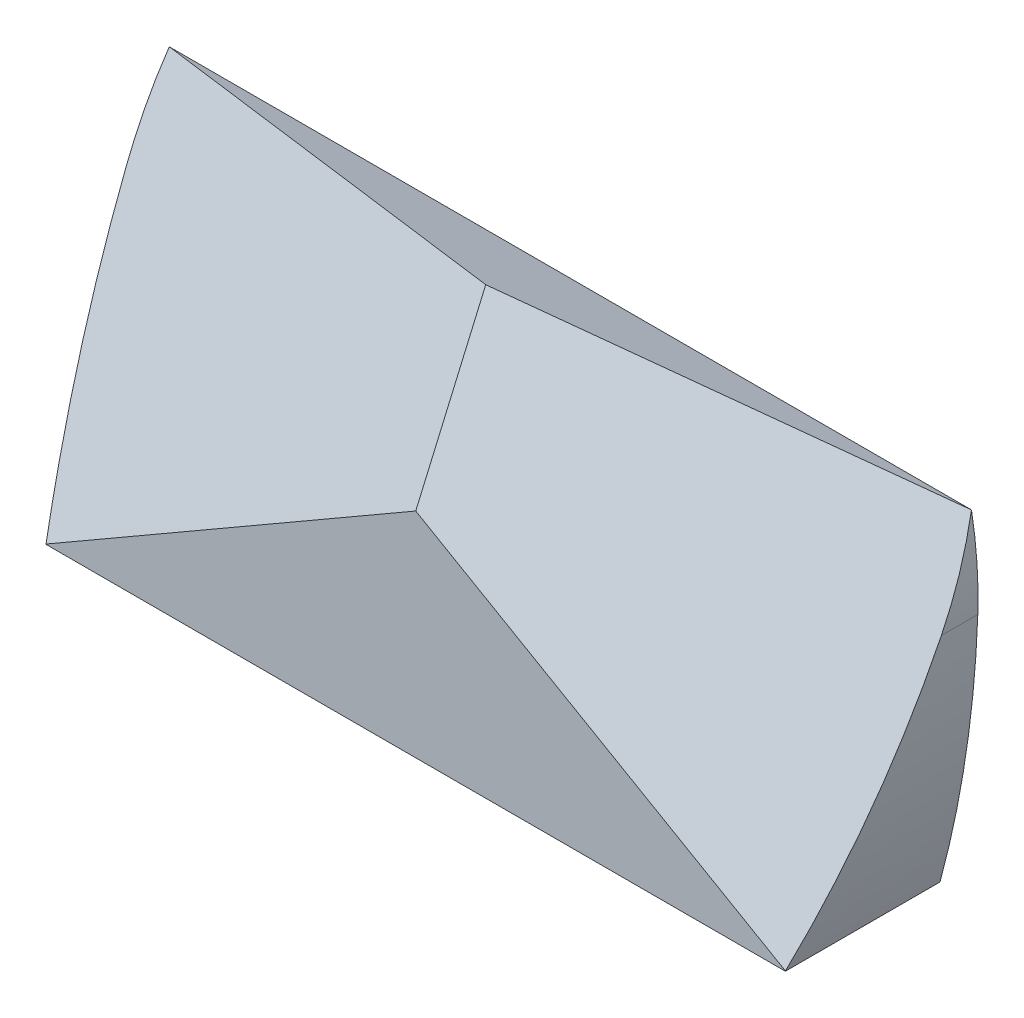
ISO-10303-21;
HEADER;
FILE_DESCRIPTION(('STEP AP214'),'2;1');
FILE_NAME('part.step','',(''),(''),'','','');
FILE_SCHEMA(('AUTOMOTIVE_DESIGN { 1 0 10303 214 1 1 1 1 }'));
ENDSEC;
DATA;
#1=APPLICATION_CONTEXT('core data for automotive mechanical design processes');
#2=APPLICATION_PROTOCOL_DEFINITION('international standard','automotive_design',2000,#1);
#3=PRODUCT_CONTEXT('',#1,'mechanical');
#4=PRODUCT('Part','Part','',(#3));
#5=PRODUCT_RELATED_PRODUCT_CATEGORY('part','',(#4));
#6=PRODUCT_DEFINITION_FORMATION('','',#4);
#7=PRODUCT_DEFINITION_CONTEXT('part definition',#1,'design');
#8=PRODUCT_DEFINITION('design','',#6,#7);
#9=PRODUCT_DEFINITION_SHAPE('','',#8);
#10=(LENGTH_UNIT() NAMED_UNIT(*) SI_UNIT(.MILLI.,.METRE.));
#11=(NAMED_UNIT(*) PLANE_ANGLE_UNIT() SI_UNIT($,.RADIAN.));
#12=(NAMED_UNIT(*) SI_UNIT($,.STERADIAN.) SOLID_ANGLE_UNIT());
#13=UNCERTAINTY_MEASURE_WITH_UNIT(LENGTH_MEASURE(1.E-05),#10,'distance_accuracy_value','');
#14=(GEOMETRIC_REPRESENTATION_CONTEXT(3) GLOBAL_UNCERTAINTY_ASSIGNED_CONTEXT((#13)) GLOBAL_UNIT_ASSIGNED_CONTEXT((#10,
#11,#12)) REPRESENTATION_CONTEXT('',''));
#15=CARTESIAN_POINT('',(0.,0.,0.));
#16=DIRECTION('',(0.,0.,1.));
#17=DIRECTION('',(1.,0.,0.));
#18=AXIS2_PLACEMENT_3D('',#15,#16,#17);
#19=CARTESIAN_POINT('',(31.1649708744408,36.0291040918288,-98.7276));
#20=DIRECTION('',(0.,0.,-1.));
#21=DIRECTION('',(-1.,0.,0.));
#22=AXIS2_PLACEMENT_3D('',#19,#20,#21);
#23=CYLINDRICAL_SURFACE('',#22,49.135);
#24=CARTESIAN_POINT('',(31.1649708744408,36.0291040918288,-100.917757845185));
#25=DIRECTION('',(0.,0.,1.));
#26=DIRECTION('',(1.,0.,0.));
#27=AXIS2_PLACEMENT_3D('',#24,#25,#26);
#28=CIRCLE('',#27,49.135);
#29=CARTESIAN_POINT('',(-16.2793466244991,23.2508036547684,-100.917757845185));
#30=VERTEX_POINT('',#29);
#31=CARTESIAN_POINT('',(-16.2759232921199,23.2381,-100.917757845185));
#32=VERTEX_POINT('',#31);
#33=EDGE_CURVE('E156',#30,#32,#28,.T.);
#34=ORIENTED_EDGE('',*,*,#33,.F.);
#35=CARTESIAN_POINT('',(31.1649708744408,36.0291040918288,-94.5647660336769));
#36=DIRECTION('',(-0.224314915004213,0.388524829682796,0.893717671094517));
#37=DIRECTION('',(-0.446858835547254,0.773982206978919,-0.44862983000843));
#38=AXIS2_PLACEMENT_3D('',#35,#36,#37);
#39=ELLIPSE('',#38,54.9782124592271,49.135);
#40=CARTESIAN_POINT('',(-17.9384712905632,34.2683677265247,-106.123835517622));
#41=VERTEX_POINT('',#40);
#42=EDGE_CURVE('E102',#41,#30,#39,.T.);
#43=ORIENTED_EDGE('',*,*,#42,.F.);
#44=DIRECTION('',(0.,0.,-1.));
#45=VECTOR('',#44,1.);
#46=CARTESIAN_POINT('',(-17.9384712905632,34.2683677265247,-98.7276));
#47=LINE('',#46,#45);
#48=CARTESIAN_POINT('',(-17.9384712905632,34.2683677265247,-107.7276));
#49=VERTEX_POINT('',#48);
#50=EDGE_CURVE('E137',#41,#49,#47,.T.);
#51=ORIENTED_EDGE('',*,*,#50,.T.);
#52=CARTESIAN_POINT('',(31.1649708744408,36.0291040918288,-107.7276));
#53=DIRECTION('',(0.,0.,1.));
#54=DIRECTION('',(1.,0.,0.));
#55=AXIS2_PLACEMENT_3D('',#52,#53,#54);
#56=CIRCLE('',#55,49.135);
#57=CARTESIAN_POINT('',(-16.2759232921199,23.2381,-107.7276));
#58=VERTEX_POINT('',#57);
#59=EDGE_CURVE('E119',#49,#58,#56,.T.);
#60=ORIENTED_EDGE('',*,*,#59,.T.);
#61=DIRECTION('',(0.,0.,-1.));
#62=VECTOR('',#61,1.);
#63=CARTESIAN_POINT('',(-16.2759232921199,23.2381,-98.7276));
#64=LINE('',#63,#62);
#65=EDGE_CURVE('E135',#32,#58,#64,.T.);
#66=ORIENTED_EDGE('',*,*,#65,.F.);
#67=EDGE_LOOP('',(#34,#43,#51,#60,#66));
#68=FACE_BOUND('',#67,.T.);
#69=ADVANCED_FACE('F32',(#68),#23,.T.);
#70=CARTESIAN_POINT('',(-31.1649708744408,36.0291040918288,-98.7276));
#71=DIRECTION('',(0.,0.,-1.));
#72=DIRECTION('',(-1.,0.,0.));
#73=AXIS2_PLACEMENT_3D('',#70,#71,#72);
#74=CYLINDRICAL_SURFACE('',#73,49.135);
#75=CARTESIAN_POINT('',(-31.1649708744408,36.0291040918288,-100.917757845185));
#76=DIRECTION('',(0.,0.,1.));
#77=DIRECTION('',(1.,0.,0.));
#78=AXIS2_PLACEMENT_3D('',#75,#76,#77);
#79=CIRCLE('',#78,49.135);
#80=CARTESIAN_POINT('',(16.2759232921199,23.2381,-100.917757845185));
#81=VERTEX_POINT('',#80);
#82=CARTESIAN_POINT('',(16.2793466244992,23.2508036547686,-100.917757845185));
#83=VERTEX_POINT('',#82);
#84=EDGE_CURVE('E47',#81,#83,#79,.T.);
#85=ORIENTED_EDGE('',*,*,#84,.F.);
#86=DIRECTION('',(0.,0.,-1.));
#87=VECTOR('',#86,1.);
#88=CARTESIAN_POINT('',(16.2759232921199,23.2381,-98.7276));
#89=LINE('',#88,#87);
#90=CARTESIAN_POINT('',(16.2759232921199,23.2381,-107.7276));
#91=VERTEX_POINT('',#90);
#92=EDGE_CURVE('E133',#81,#91,#89,.T.);
#93=ORIENTED_EDGE('',*,*,#92,.T.);
#94=CARTESIAN_POINT('',(-31.1649708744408,36.0291040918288,-107.7276));
#95=DIRECTION('',(0.,0.,1.));
#96=DIRECTION('',(1.,0.,0.));
#97=AXIS2_PLACEMENT_3D('',#94,#95,#96);
#98=CIRCLE('',#97,49.135);
#99=CARTESIAN_POINT('',(17.9384712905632,34.2683677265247,-107.7276));
#100=VERTEX_POINT('',#99);
#101=EDGE_CURVE('E125',#91,#100,#98,.T.);
#102=ORIENTED_EDGE('',*,*,#101,.T.);
#103=DIRECTION('',(0.,0.,-1.));
#104=VECTOR('',#103,1.);
#105=CARTESIAN_POINT('',(17.9384712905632,34.2683677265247,-98.7276));
#106=LINE('',#105,#104);
#107=CARTESIAN_POINT('',(17.9384712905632,34.2683677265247,-106.123835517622));
#108=VERTEX_POINT('',#107);
#109=EDGE_CURVE('E54',#108,#100,#106,.T.);
#110=ORIENTED_EDGE('',*,*,#109,.F.);
#111=CARTESIAN_POINT('',(-31.1649708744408,36.0291040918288,-94.5647660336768));
#112=DIRECTION('',(0.224314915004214,0.388524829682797,0.893717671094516));
#113=DIRECTION('',(0.446858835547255,0.773982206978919,-0.448629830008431));
#114=AXIS2_PLACEMENT_3D('',#111,#112,#113);
#115=ELLIPSE('',#114,54.9782124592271,49.135);
#116=EDGE_CURVE('E108',#83,#108,#115,.T.);
#117=ORIENTED_EDGE('',*,*,#116,.F.);
#118=EDGE_LOOP('',(#85,#93,#102,#110,#117));
#119=FACE_BOUND('',#118,.T.);
#120=ADVANCED_FACE('F163',(#119),#74,.T.);
#121=CARTESIAN_POINT('',(-16.2759232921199,23.2381,-98.7276));
#122=DIRECTION('',(0.,1.,0.));
#123=DIRECTION('',(0.,0.,1.));
#124=AXIS2_PLACEMENT_3D('',#121,#122,#123);
#125=PLANE('',#124);
#126=DIRECTION('',(1.,0.,0.));
#127=VECTOR('',#126,1.);
#128=CARTESIAN_POINT('',(-16.2759232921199,23.2381,-100.917757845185));
#129=LINE('',#128,#127);
#130=EDGE_CURVE('E158',#32,#81,#129,.T.);
#131=ORIENTED_EDGE('',*,*,#130,.F.);
#132=ORIENTED_EDGE('',*,*,#65,.T.);
#133=DIRECTION('',(1.,0.,0.));
#134=VECTOR('',#133,1.);
#135=CARTESIAN_POINT('',(-16.2759232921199,23.2381,-107.7276));
#136=LINE('',#135,#134);
#137=EDGE_CURVE('E122',#58,#91,#136,.T.);
#138=ORIENTED_EDGE('',*,*,#137,.T.);
#139=ORIENTED_EDGE('',*,*,#92,.F.);
#140=EDGE_LOOP('',(#131,#132,#138,#139));
#141=FACE_BOUND('',#140,.T.);
#142=ADVANCED_FACE('F166',(#141),#125,.F.);
#143=CARTESIAN_POINT('',(-24.9305332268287,12.7405788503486,-98.5200284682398));
#144=DIRECTION('',(-0.224314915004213,0.388524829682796,0.893717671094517));
#145=DIRECTION('',(0.,-0.917088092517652,0.398684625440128));
#146=AXIS2_PLACEMENT_3D('',#143,#144,#145);
#147=PLANE('',#146);
#148=ORIENTED_EDGE('',*,*,#42,.T.);
#149=DIRECTION('',(0.866025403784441,0.499999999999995,0.));
#150=VECTOR('',#149,1.);
#151=CARTESIAN_POINT('',(-27.3187974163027,16.877173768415,-100.917757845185));
#152=LINE('',#151,#150);
#153=CARTESIAN_POINT('',(2.56955914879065E-13,32.6496888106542,-100.917757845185));
#154=VERTEX_POINT('',#153);
#155=EDGE_CURVE('E91',#30,#154,#152,.T.);
#156=ORIENTED_EDGE('',*,*,#155,.T.);
#157=DIRECTION('',(0.,0.917088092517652,-0.398684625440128));
#158=VECTOR('',#157,1.);
#159=CARTESIAN_POINT('',(2.74086309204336E-13,15.0284413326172,-93.2572937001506));
#160=LINE('',#159,#158);
#161=CARTESIAN_POINT('',(2.65412691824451E-13,39.7382277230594,-103.99935001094));
#162=VERTEX_POINT('',#161);
#163=EDGE_CURVE('E99',#154,#162,#160,.T.);
#164=ORIENTED_EDGE('',*,*,#163,.T.);
#165=DIRECTION('',(-0.974516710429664,-0.0894309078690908,-0.205716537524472));
#166=VECTOR('',#165,1.);
#167=CARTESIAN_POINT('',(-24.9305332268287,37.4503652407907,-109.262084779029));
#168=LINE('',#167,#166);
#169=CARTESIAN_POINT('',(-17.6613993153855,38.11745,-107.7276));
#170=VERTEX_POINT('',#169);
#171=EDGE_CURVE('E139',#162,#170,#168,.T.);
#172=ORIENTED_EDGE('',*,*,#171,.T.);
#173=CARTESIAN_POINT('',(0.,34.9116,-101.901075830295));
#174=DIRECTION('',(-0.224314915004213,0.388524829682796,0.893717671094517));
#175=DIRECTION('',(-0.446858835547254,0.773982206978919,-0.44862983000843));
#176=AXIS2_PLACEMENT_3D('',#173,#174,#175);
#177=ELLIPSE('',#176,20.0846425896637,17.95);
#178=EDGE_CURVE('E107',#170,#41,#177,.T.);
#179=ORIENTED_EDGE('',*,*,#178,.T.);
#180=EDGE_LOOP('',(#148,#156,#164,#172,#179));
#181=FACE_BOUND('',#180,.T.);
#182=ADVANCED_FACE('F98',(#181),#147,.T.);
#183=CARTESIAN_POINT('',(-8.8329638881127,13.8078259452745,-90.5096643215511));
#184=DIRECTION('',(0.224314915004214,0.388524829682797,0.893717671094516));
#185=DIRECTION('',(0.,-0.917088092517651,0.398684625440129));
#186=AXIS2_PLACEMENT_3D('',#183,#184,#185);
#187=PLANE('',#186);
#188=ORIENTED_EDGE('',*,*,#163,.F.);
#189=DIRECTION('',(0.866025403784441,-0.499999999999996,0.));
#190=VECTOR('',#189,1.);
#191=CARTESIAN_POINT('',(1.53404303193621,31.7640086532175,-100.917757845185));
#192=LINE('',#191,#190);
#193=EDGE_CURVE('E11',#154,#83,#192,.T.);
#194=ORIENTED_EDGE('',*,*,#193,.T.);
#195=ORIENTED_EDGE('',*,*,#116,.T.);
#196=CARTESIAN_POINT('',(0.,34.9116,-101.901075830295));
#197=DIRECTION('',(0.224314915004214,0.388524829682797,0.893717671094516));
#198=DIRECTION('',(0.446858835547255,0.773982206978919,-0.448629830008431));
#199=AXIS2_PLACEMENT_3D('',#196,#197,#198);
#200=ELLIPSE('',#199,20.0846425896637,17.95);
#201=CARTESIAN_POINT('',(17.6613993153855,38.11745,-107.7276));
#202=VERTEX_POINT('',#201);
#203=EDGE_CURVE('E111',#108,#202,#200,.T.);
#204=ORIENTED_EDGE('',*,*,#203,.T.);
#205=DIRECTION('',(0.974516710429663,-0.0894309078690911,-0.205716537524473));
#206=VECTOR('',#205,1.);
#207=CARTESIAN_POINT('',(42.1613958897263,35.8690976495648,-112.899450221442));
#208=LINE('',#207,#206);
#209=EDGE_CURVE('E40',#162,#202,#208,.T.);
#210=ORIENTED_EDGE('',*,*,#209,.F.);
#211=EDGE_LOOP('',(#188,#194,#195,#204,#210));
#212=FACE_BOUND('',#211,.T.);
#213=ADVANCED_FACE('F104',(#212),#187,.T.);
#214=CARTESIAN_POINT('',(0.,34.9116,-98.7276));
#215=DIRECTION('',(0.,0.,-1.));
#216=DIRECTION('',(-1.,0.,0.));
#217=AXIS2_PLACEMENT_3D('',#214,#215,#216);
#218=CYLINDRICAL_SURFACE('',#217,17.95);
#219=ORIENTED_EDGE('',*,*,#178,.F.);
#220=CARTESIAN_POINT('',(0.,34.9116,-107.7276));
#221=DIRECTION('',(0.,0.,1.));
#222=DIRECTION('',(1.,0.,0.));
#223=AXIS2_PLACEMENT_3D('',#220,#221,#222);
#224=CIRCLE('',#223,17.95);
#225=EDGE_CURVE('E116',#170,#49,#224,.T.);
#226=ORIENTED_EDGE('',*,*,#225,.T.);
#227=ORIENTED_EDGE('',*,*,#50,.F.);
#228=EDGE_LOOP('',(#219,#226,#227));
#229=FACE_BOUND('',#228,.T.);
#230=ADVANCED_FACE('F34',(#229),#218,.T.);
#231=CARTESIAN_POINT('',(0.,34.9116,-107.7276));
#232=DIRECTION('',(0.,0.,1.));
#233=DIRECTION('',(1.,0.,0.));
#234=AXIS2_PLACEMENT_3D('',#231,#232,#233);
#235=PLANE('',#234);
#236=ORIENTED_EDGE('',*,*,#225,.F.);
#237=DIRECTION('',(-1.,0.,0.));
#238=VECTOR('',#237,1.);
#239=CARTESIAN_POINT('',(-17.6613993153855,38.11745,-107.7276));
#240=LINE('',#239,#238);
#241=EDGE_CURVE('E129',#202,#170,#240,.T.);
#242=ORIENTED_EDGE('',*,*,#241,.F.);
#243=CARTESIAN_POINT('',(0.,34.9116,-107.7276));
#244=DIRECTION('',(0.,0.,1.));
#245=DIRECTION('',(1.,0.,0.));
#246=AXIS2_PLACEMENT_3D('',#243,#244,#245);
#247=CIRCLE('',#246,17.95);
#248=EDGE_CURVE('E127',#100,#202,#247,.T.);
#249=ORIENTED_EDGE('',*,*,#248,.F.);
#250=ORIENTED_EDGE('',*,*,#101,.F.);
#251=ORIENTED_EDGE('',*,*,#137,.F.);
#252=ORIENTED_EDGE('',*,*,#59,.F.);
#253=EDGE_LOOP('',(#236,#242,#249,#250,#251,#252));
#254=FACE_BOUND('',#253,.T.);
#255=ADVANCED_FACE('F149',(#254),#235,.F.);
#256=CARTESIAN_POINT('',(42.0199175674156,35.6240500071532,-113.463129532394));
#257=DIRECTION('',(0.,0.917088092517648,-0.398684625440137));
#258=DIRECTION('',(0.,0.398684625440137,0.917088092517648));
#259=AXIS2_PLACEMENT_3D('',#256,#257,#258);
#260=PLANE('',#259);
#261=ORIENTED_EDGE('',*,*,#171,.F.);
#262=ORIENTED_EDGE('',*,*,#209,.T.);
#263=ORIENTED_EDGE('',*,*,#241,.T.);
#264=EDGE_LOOP('',(#261,#262,#263));
#265=FACE_BOUND('',#264,.T.);
#266=ADVANCED_FACE('F141',(#265),#260,.T.);
#267=CARTESIAN_POINT('',(0.,34.9116,-98.7276));
#268=DIRECTION('',(0.,0.,-1.));
#269=DIRECTION('',(-1.,0.,0.));
#270=AXIS2_PLACEMENT_3D('',#267,#268,#269);
#271=CYLINDRICAL_SURFACE('',#270,17.95);
#272=ORIENTED_EDGE('',*,*,#203,.F.);
#273=ORIENTED_EDGE('',*,*,#109,.T.);
#274=ORIENTED_EDGE('',*,*,#248,.T.);
#275=EDGE_LOOP('',(#272,#273,#274));
#276=FACE_BOUND('',#275,.T.);
#277=ADVANCED_FACE('F145',(#276),#271,.T.);
#278=CARTESIAN_POINT('',(-19.3788807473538,8.32817435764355,-100.917757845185));
#279=DIRECTION('',(0.,0.,1.));
#280=DIRECTION('',(1.,0.,0.));
#281=AXIS2_PLACEMENT_3D('',#278,#279,#280);
#282=PLANE('',#281);
#283=ORIENTED_EDGE('',*,*,#130,.T.);
#284=ORIENTED_EDGE('',*,*,#84,.T.);
#285=ORIENTED_EDGE('',*,*,#193,.F.);
#286=ORIENTED_EDGE('',*,*,#155,.F.);
#287=ORIENTED_EDGE('',*,*,#33,.T.);
#288=EDGE_LOOP('',(#283,#284,#285,#286,#287));
#289=FACE_BOUND('',#288,.T.);
#290=ADVANCED_FACE('F90',(#289),#282,.T.);
#291=CLOSED_SHELL('',(#69,#120,#142,#182,#213,#230,#255,#266,#277,#290));
#292=MANIFOLD_SOLID_BREP('B2',#291);
#293=ADVANCED_BREP_SHAPE_REPRESENTATION('',(#18,#292),#14);
#294=SHAPE_DEFINITION_REPRESENTATION(#9,#293);
ENDSEC;
END-ISO-10303-21;
